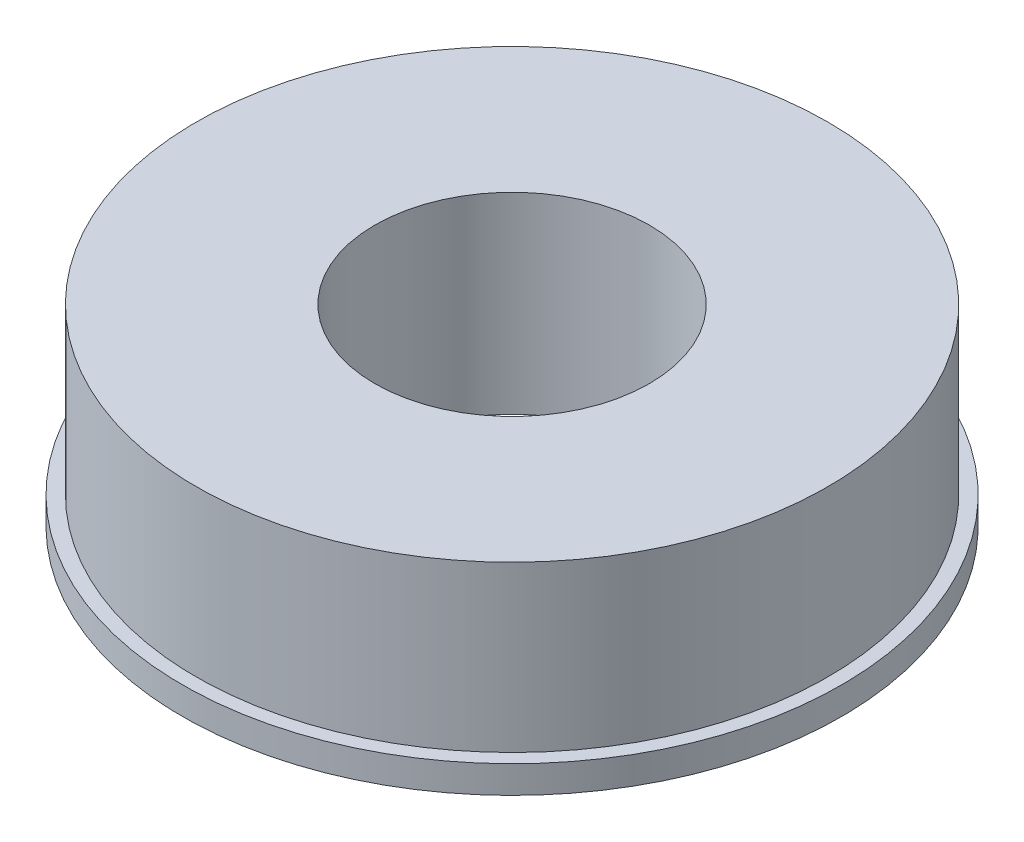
ISO-10303-21;
HEADER;
FILE_DESCRIPTION(('STEP AP214'),'2;1');
FILE_NAME('part.step','',(''),(''),'','','');
FILE_SCHEMA(('AUTOMOTIVE_DESIGN { 1 0 10303 214 1 1 1 1 }'));
ENDSEC;
DATA;
#1=APPLICATION_CONTEXT('core data for automotive mechanical design processes');
#2=APPLICATION_PROTOCOL_DEFINITION('international standard','automotive_design',2000,#1);
#3=PRODUCT_CONTEXT('',#1,'mechanical');
#4=PRODUCT('Part','Part','',(#3));
#5=PRODUCT_RELATED_PRODUCT_CATEGORY('part','',(#4));
#6=PRODUCT_DEFINITION_FORMATION('','',#4);
#7=PRODUCT_DEFINITION_CONTEXT('part definition',#1,'design');
#8=PRODUCT_DEFINITION('design','',#6,#7);
#9=PRODUCT_DEFINITION_SHAPE('','',#8);
#10=(LENGTH_UNIT() NAMED_UNIT(*) SI_UNIT(.MILLI.,.METRE.));
#11=(NAMED_UNIT(*) PLANE_ANGLE_UNIT() SI_UNIT($,.RADIAN.));
#12=(NAMED_UNIT(*) SI_UNIT($,.STERADIAN.) SOLID_ANGLE_UNIT());
#13=UNCERTAINTY_MEASURE_WITH_UNIT(LENGTH_MEASURE(1.E-05),#10,'distance_accuracy_value','');
#14=(GEOMETRIC_REPRESENTATION_CONTEXT(3) GLOBAL_UNCERTAINTY_ASSIGNED_CONTEXT((#13)) GLOBAL_UNIT_ASSIGNED_CONTEXT((#10,
#11,#12)) REPRESENTATION_CONTEXT('',''));
#15=CARTESIAN_POINT('',(0.,0.,0.));
#16=DIRECTION('',(0.,0.,1.));
#17=DIRECTION('',(1.,0.,0.));
#18=AXIS2_PLACEMENT_3D('',#15,#16,#17);
#19=CARTESIAN_POINT('',(0.,7.,0.));
#20=DIRECTION('',(0.,-1.,0.));
#21=DIRECTION('',(0.,0.,-1.));
#22=AXIS2_PLACEMENT_3D('',#19,#20,#21);
#23=CYLINDRICAL_SURFACE('',#22,5.);
#24=CARTESIAN_POINT('',(0.,0.,0.));
#25=DIRECTION('',(0.,-1.,0.));
#26=DIRECTION('',(0.,0.,-1.));
#27=AXIS2_PLACEMENT_3D('',#24,#25,#26);
#28=CIRCLE('',#27,5.);
#29=CARTESIAN_POINT('',(0.,0.,-5.));
#30=VERTEX_POINT('',#29);
#31=EDGE_CURVE('E10',#30,#30,#28,.T.);
#32=ORIENTED_EDGE('',*,*,#31,.T.);
#33=EDGE_LOOP('',(#32));
#34=FACE_BOUND('',#33,.T.);
#35=CARTESIAN_POINT('',(0.,7.,0.));
#36=DIRECTION('',(0.,-1.,0.));
#37=DIRECTION('',(0.,0.,-1.));
#38=AXIS2_PLACEMENT_3D('',#35,#36,#37);
#39=CIRCLE('',#38,5.);
#40=CARTESIAN_POINT('',(0.,7.,-5.));
#41=VERTEX_POINT('',#40);
#42=EDGE_CURVE('E51',#41,#41,#39,.T.);
#43=ORIENTED_EDGE('',*,*,#42,.F.);
#44=EDGE_LOOP('',(#43));
#45=FACE_BOUND('',#44,.T.);
#46=ADVANCED_FACE('F29',(#34,#45),#23,.F.);
#47=CARTESIAN_POINT('',(5.,0.,0.));
#48=DIRECTION('',(0.,-1.,0.));
#49=DIRECTION('',(0.,0.,-1.));
#50=AXIS2_PLACEMENT_3D('',#47,#48,#49);
#51=PLANE('',#50);
#52=CARTESIAN_POINT('',(0.,0.,0.));
#53=DIRECTION('',(0.,-1.,0.));
#54=DIRECTION('',(0.,0.,-1.));
#55=AXIS2_PLACEMENT_3D('',#52,#53,#54);
#56=CIRCLE('',#55,12.);
#57=CARTESIAN_POINT('',(0.,0.,-12.));
#58=VERTEX_POINT('',#57);
#59=EDGE_CURVE('E35',#58,#58,#56,.T.);
#60=ORIENTED_EDGE('',*,*,#59,.T.);
#61=EDGE_LOOP('',(#60));
#62=FACE_BOUND('',#61,.T.);
#63=ORIENTED_EDGE('',*,*,#31,.F.);
#64=EDGE_LOOP('',(#63));
#65=FACE_BOUND('',#64,.T.);
#66=ADVANCED_FACE('F59',(#62,#65),#51,.T.);
#67=CARTESIAN_POINT('',(0.,7.,0.));
#68=DIRECTION('',(0.,-1.,0.));
#69=DIRECTION('',(0.,0.,-1.));
#70=AXIS2_PLACEMENT_3D('',#67,#68,#69);
#71=CYLINDRICAL_SURFACE('',#70,12.);
#72=CARTESIAN_POINT('',(0.,1.,0.));
#73=DIRECTION('',(0.,-1.,0.));
#74=DIRECTION('',(0.,0.,-1.));
#75=AXIS2_PLACEMENT_3D('',#72,#73,#74);
#76=CIRCLE('',#75,12.);
#77=CARTESIAN_POINT('',(0.,1.,-12.));
#78=VERTEX_POINT('',#77);
#79=EDGE_CURVE('E39',#78,#78,#76,.T.);
#80=ORIENTED_EDGE('',*,*,#79,.T.);
#81=EDGE_LOOP('',(#80));
#82=FACE_BOUND('',#81,.T.);
#83=ORIENTED_EDGE('',*,*,#59,.F.);
#84=EDGE_LOOP('',(#83));
#85=FACE_BOUND('',#84,.T.);
#86=ADVANCED_FACE('F63',(#82,#85),#71,.T.);
#87=CARTESIAN_POINT('',(12.,1.,0.));
#88=DIRECTION('',(0.,1.,0.));
#89=DIRECTION('',(0.,0.,1.));
#90=AXIS2_PLACEMENT_3D('',#87,#88,#89);
#91=PLANE('',#90);
#92=CARTESIAN_POINT('',(0.,1.,0.));
#93=DIRECTION('',(0.,-1.,0.));
#94=DIRECTION('',(0.,0.,-1.));
#95=AXIS2_PLACEMENT_3D('',#92,#93,#94);
#96=CIRCLE('',#95,11.5);
#97=CARTESIAN_POINT('',(0.,1.,-11.5));
#98=VERTEX_POINT('',#97);
#99=EDGE_CURVE('E43',#98,#98,#96,.T.);
#100=ORIENTED_EDGE('',*,*,#99,.T.);
#101=EDGE_LOOP('',(#100));
#102=FACE_BOUND('',#101,.T.);
#103=ORIENTED_EDGE('',*,*,#79,.F.);
#104=EDGE_LOOP('',(#103));
#105=FACE_BOUND('',#104,.T.);
#106=ADVANCED_FACE('F67',(#102,#105),#91,.T.);
#107=CARTESIAN_POINT('',(0.,7.,0.));
#108=DIRECTION('',(0.,-1.,0.));
#109=DIRECTION('',(0.,0.,-1.));
#110=AXIS2_PLACEMENT_3D('',#107,#108,#109);
#111=CYLINDRICAL_SURFACE('',#110,11.5);
#112=CARTESIAN_POINT('',(0.,7.,0.));
#113=DIRECTION('',(0.,-1.,0.));
#114=DIRECTION('',(0.,0.,-1.));
#115=AXIS2_PLACEMENT_3D('',#112,#113,#114);
#116=CIRCLE('',#115,11.5);
#117=CARTESIAN_POINT('',(0.,7.,-11.5));
#118=VERTEX_POINT('',#117);
#119=EDGE_CURVE('E48',#118,#118,#116,.T.);
#120=ORIENTED_EDGE('',*,*,#119,.T.);
#121=EDGE_LOOP('',(#120));
#122=FACE_BOUND('',#121,.T.);
#123=ORIENTED_EDGE('',*,*,#99,.F.);
#124=EDGE_LOOP('',(#123));
#125=FACE_BOUND('',#124,.T.);
#126=ADVANCED_FACE('F74',(#122,#125),#111,.T.);
#127=CARTESIAN_POINT('',(11.5,7.,0.));
#128=DIRECTION('',(0.,1.,0.));
#129=DIRECTION('',(0.,0.,1.));
#130=AXIS2_PLACEMENT_3D('',#127,#128,#129);
#131=PLANE('',#130);
#132=ORIENTED_EDGE('',*,*,#42,.T.);
#133=EDGE_LOOP('',(#132));
#134=FACE_BOUND('',#133,.T.);
#135=ORIENTED_EDGE('',*,*,#119,.F.);
#136=EDGE_LOOP('',(#135));
#137=FACE_BOUND('',#136,.T.);
#138=ADVANCED_FACE('F55',(#134,#137),#131,.T.);
#139=CLOSED_SHELL('',(#46,#66,#86,#106,#126,#138));
#140=MANIFOLD_SOLID_BREP('B2',#139);
#141=ADVANCED_BREP_SHAPE_REPRESENTATION('',(#18,#140),#14);
#142=SHAPE_DEFINITION_REPRESENTATION(#9,#141);
ENDSEC;
END-ISO-10303-21;
